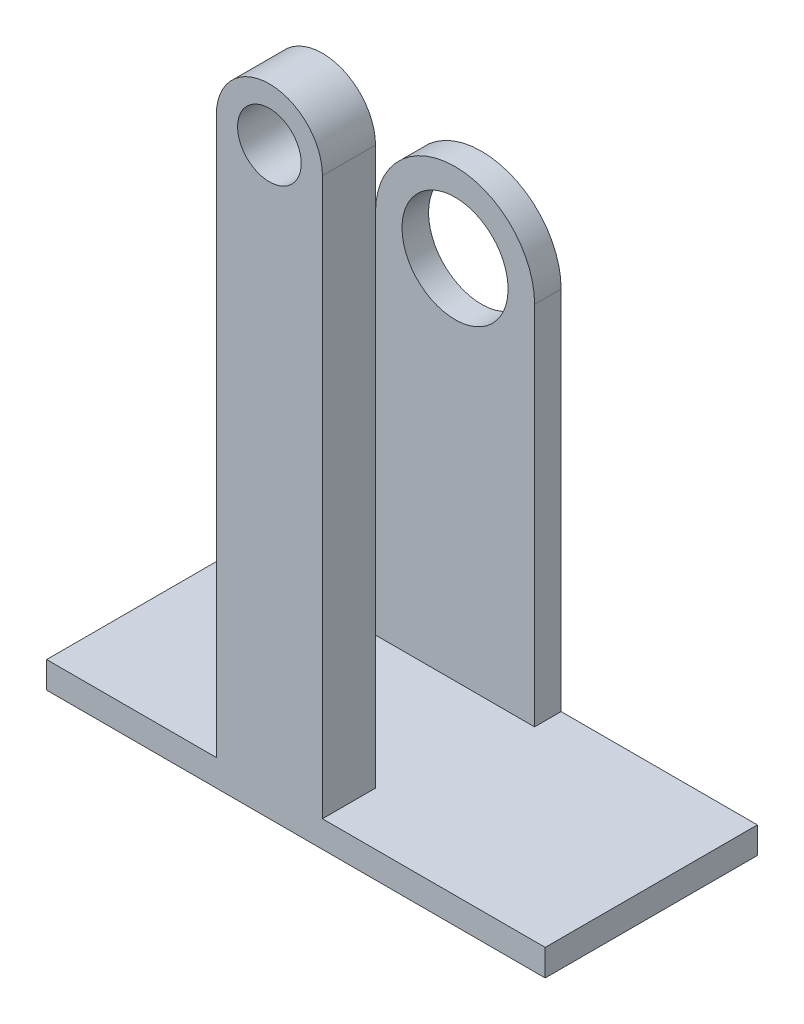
ISO-10303-21;
HEADER;
FILE_DESCRIPTION(('STEP AP214'),'2;1');
FILE_NAME('part.step','',(''),(''),'','','');
FILE_SCHEMA(('AUTOMOTIVE_DESIGN { 1 0 10303 214 1 1 1 1 }'));
ENDSEC;
DATA;
#1=APPLICATION_CONTEXT('core data for automotive mechanical design processes');
#2=APPLICATION_PROTOCOL_DEFINITION('international standard','automotive_design',2000,#1);
#3=PRODUCT_CONTEXT('',#1,'mechanical');
#4=PRODUCT('Part','Part','',(#3));
#5=PRODUCT_RELATED_PRODUCT_CATEGORY('part','',(#4));
#6=PRODUCT_DEFINITION_FORMATION('','',#4);
#7=PRODUCT_DEFINITION_CONTEXT('part definition',#1,'design');
#8=PRODUCT_DEFINITION('design','',#6,#7);
#9=PRODUCT_DEFINITION_SHAPE('','',#8);
#10=(LENGTH_UNIT() NAMED_UNIT(*) SI_UNIT(.MILLI.,.METRE.));
#11=(NAMED_UNIT(*) PLANE_ANGLE_UNIT() SI_UNIT($,.RADIAN.));
#12=(NAMED_UNIT(*) SI_UNIT($,.STERADIAN.) SOLID_ANGLE_UNIT());
#13=UNCERTAINTY_MEASURE_WITH_UNIT(LENGTH_MEASURE(1.E-05),#10,'distance_accuracy_value','');
#14=(GEOMETRIC_REPRESENTATION_CONTEXT(3) GLOBAL_UNCERTAINTY_ASSIGNED_CONTEXT((#13)) GLOBAL_UNIT_ASSIGNED_CONTEXT((#10,
#11,#12)) REPRESENTATION_CONTEXT('',''));
#15=CARTESIAN_POINT('',(0.,0.,0.));
#16=DIRECTION('',(0.,0.,1.));
#17=DIRECTION('',(1.,0.,0.));
#18=AXIS2_PLACEMENT_3D('',#15,#16,#17);
#19=CARTESIAN_POINT('',(0.,36.,10.));
#20=DIRECTION('',(0.,0.,1.));
#21=DIRECTION('',(1.,0.,0.));
#22=AXIS2_PLACEMENT_3D('',#19,#20,#21);
#23=PLANE('',#22);
#24=DIRECTION('',(0.,-1.,0.));
#25=VECTOR('',#24,1.);
#26=CARTESIAN_POINT('',(-10.,36.,10.));
#27=LINE('',#26,#25);
#28=CARTESIAN_POINT('',(-10.,36.,10.));
#29=VERTEX_POINT('',#28);
#30=CARTESIAN_POINT('',(-9.99999999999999,-69.,10.));
#31=VERTEX_POINT('',#30);
#32=EDGE_CURVE('E199',#29,#31,#27,.T.);
#33=ORIENTED_EDGE('',*,*,#32,.T.);
#34=DIRECTION('',(-1.,0.,0.));
#35=VECTOR('',#34,1.);
#36=CARTESIAN_POINT('',(-42.,-69.,10.));
#37=LINE('',#36,#35);
#38=CARTESIAN_POINT('',(-42.,-69.,10.));
#39=VERTEX_POINT('',#38);
#40=EDGE_CURVE('E168',#31,#39,#37,.T.);
#41=ORIENTED_EDGE('',*,*,#40,.T.);
#42=DIRECTION('',(0.,-1.,0.));
#43=VECTOR('',#42,1.);
#44=CARTESIAN_POINT('',(-42.,-74.,10.));
#45=LINE('',#44,#43);
#46=CARTESIAN_POINT('',(-42.,-74.,10.));
#47=VERTEX_POINT('',#46);
#48=EDGE_CURVE('E162',#39,#47,#45,.T.);
#49=ORIENTED_EDGE('',*,*,#48,.T.);
#50=DIRECTION('',(1.,0.,0.));
#51=VECTOR('',#50,1.);
#52=CARTESIAN_POINT('',(-9.99999999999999,-74.,10.));
#53=LINE('',#52,#51);
#54=CARTESIAN_POINT('',(52.,-74.,10.));
#55=VERTEX_POINT('',#54);
#56=EDGE_CURVE('E202',#47,#55,#53,.T.);
#57=ORIENTED_EDGE('',*,*,#56,.T.);
#58=DIRECTION('',(0.,1.,0.));
#59=VECTOR('',#58,1.);
#60=CARTESIAN_POINT('',(52.,-74.,10.));
#61=LINE('',#60,#59);
#62=CARTESIAN_POINT('',(52.,-69.,10.));
#63=VERTEX_POINT('',#62);
#64=EDGE_CURVE('E165',#55,#63,#61,.T.);
#65=ORIENTED_EDGE('',*,*,#64,.T.);
#66=CARTESIAN_POINT('',(10.,-69.,10.));
#67=VERTEX_POINT('',#66);
#68=EDGE_CURVE('E169',#63,#67,#37,.T.);
#69=ORIENTED_EDGE('',*,*,#68,.T.);
#70=DIRECTION('',(0.,1.,0.));
#71=VECTOR('',#70,1.);
#72=CARTESIAN_POINT('',(10.,-74.,10.));
#73=LINE('',#72,#71);
#74=CARTESIAN_POINT('',(10.,36.,10.));
#75=VERTEX_POINT('',#74);
#76=EDGE_CURVE('E204',#67,#75,#73,.T.);
#77=ORIENTED_EDGE('',*,*,#76,.T.);
#78=CARTESIAN_POINT('',(0.,36.,10.));
#79=DIRECTION('',(0.,0.,1.));
#80=DIRECTION('',(1.,0.,0.));
#81=AXIS2_PLACEMENT_3D('',#78,#79,#80);
#82=CIRCLE('',#81,10.);
#83=EDGE_CURVE('E226',#75,#29,#82,.T.);
#84=ORIENTED_EDGE('',*,*,#83,.T.);
#85=EDGE_LOOP('',(#33,#41,#49,#57,#65,#69,#77,#84));
#86=FACE_BOUND('',#85,.T.);
#87=CARTESIAN_POINT('',(0.,36.,10.));
#88=DIRECTION('',(0.,0.,1.));
#89=DIRECTION('',(1.,0.,0.));
#90=AXIS2_PLACEMENT_3D('',#87,#88,#89);
#91=CIRCLE('',#90,6.);
#92=CARTESIAN_POINT('',(6.,36.,10.));
#93=VERTEX_POINT('',#92);
#94=EDGE_CURVE('E220',#93,#93,#91,.T.);
#95=ORIENTED_EDGE('',*,*,#94,.F.);
#96=EDGE_LOOP('',(#95));
#97=FACE_BOUND('',#96,.T.);
#98=ADVANCED_FACE('F34',(#86,#97),#23,.T.);
#99=CARTESIAN_POINT('',(0.,36.,0.));
#100=DIRECTION('',(0.,0.,1.));
#101=DIRECTION('',(1.,0.,0.));
#102=AXIS2_PLACEMENT_3D('',#99,#100,#101);
#103=PLANE('',#102);
#104=DIRECTION('',(0.,1.,0.));
#105=VECTOR('',#104,1.);
#106=CARTESIAN_POINT('',(10.,-74.,0.));
#107=LINE('',#106,#105);
#108=CARTESIAN_POINT('',(10.,-69.,0.));
#109=VERTEX_POINT('',#108);
#110=CARTESIAN_POINT('',(10.,36.,0.));
#111=VERTEX_POINT('',#110);
#112=EDGE_CURVE('E209',#109,#111,#107,.T.);
#113=ORIENTED_EDGE('',*,*,#112,.F.);
#114=DIRECTION('',(-1.,0.,0.));
#115=VECTOR('',#114,1.);
#116=CARTESIAN_POINT('',(0.,-69.,0.));
#117=LINE('',#116,#115);
#118=CARTESIAN_POINT('',(-9.99999999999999,-69.,0.));
#119=VERTEX_POINT('',#118);
#120=EDGE_CURVE('E187',#109,#119,#117,.T.);
#121=ORIENTED_EDGE('',*,*,#120,.T.);
#122=DIRECTION('',(0.,-1.,0.));
#123=VECTOR('',#122,1.);
#124=CARTESIAN_POINT('',(-10.,36.,0.));
#125=LINE('',#124,#123);
#126=CARTESIAN_POINT('',(-10.,36.,0.));
#127=VERTEX_POINT('',#126);
#128=EDGE_CURVE('E206',#127,#119,#125,.T.);
#129=ORIENTED_EDGE('',*,*,#128,.F.);
#130=CARTESIAN_POINT('',(0.,36.,0.));
#131=DIRECTION('',(0.,0.,1.));
#132=DIRECTION('',(1.,0.,0.));
#133=AXIS2_PLACEMENT_3D('',#130,#131,#132);
#134=CIRCLE('',#133,10.);
#135=EDGE_CURVE('E223',#111,#127,#134,.T.);
#136=ORIENTED_EDGE('',*,*,#135,.F.);
#137=EDGE_LOOP('',(#113,#121,#129,#136));
#138=FACE_BOUND('',#137,.T.);
#139=CARTESIAN_POINT('',(0.,36.,0.));
#140=DIRECTION('',(0.,0.,1.));
#141=DIRECTION('',(1.,0.,0.));
#142=AXIS2_PLACEMENT_3D('',#139,#140,#141);
#143=CIRCLE('',#142,6.);
#144=CARTESIAN_POINT('',(6.,36.,0.));
#145=VERTEX_POINT('',#144);
#146=EDGE_CURVE('E215',#145,#145,#143,.T.);
#147=ORIENTED_EDGE('',*,*,#146,.T.);
#148=EDGE_LOOP('',(#147));
#149=FACE_BOUND('',#148,.T.);
#150=ADVANCED_FACE('F235',(#138,#149),#103,.F.);
#151=CARTESIAN_POINT('',(0.,36.,10.));
#152=DIRECTION('',(0.,0.,-1.));
#153=DIRECTION('',(-1.,0.,0.));
#154=AXIS2_PLACEMENT_3D('',#151,#152,#153);
#155=CYLINDRICAL_SURFACE('',#154,10.);
#156=ORIENTED_EDGE('',*,*,#83,.F.);
#157=DIRECTION('',(0.,0.,1.));
#158=VECTOR('',#157,1.);
#159=CARTESIAN_POINT('',(10.,36.,0.));
#160=LINE('',#159,#158);
#161=EDGE_CURVE('E212',#111,#75,#160,.T.);
#162=ORIENTED_EDGE('',*,*,#161,.F.);
#163=ORIENTED_EDGE('',*,*,#135,.T.);
#164=DIRECTION('',(0.,0.,1.));
#165=VECTOR('',#164,1.);
#166=CARTESIAN_POINT('',(-10.,36.,0.));
#167=LINE('',#166,#165);
#168=EDGE_CURVE('E211',#127,#29,#167,.T.);
#169=ORIENTED_EDGE('',*,*,#168,.T.);
#170=EDGE_LOOP('',(#156,#162,#163,#169));
#171=FACE_BOUND('',#170,.T.);
#172=ADVANCED_FACE('F36',(#171),#155,.T.);
#173=CARTESIAN_POINT('',(0.,36.,10.));
#174=DIRECTION('',(0.,0.,-1.));
#175=DIRECTION('',(-1.,0.,0.));
#176=AXIS2_PLACEMENT_3D('',#173,#174,#175);
#177=CYLINDRICAL_SURFACE('',#176,6.);
#178=ORIENTED_EDGE('',*,*,#94,.T.);
#179=EDGE_LOOP('',(#178));
#180=FACE_BOUND('',#179,.T.);
#181=ORIENTED_EDGE('',*,*,#146,.F.);
#182=EDGE_LOOP('',(#181));
#183=FACE_BOUND('',#182,.T.);
#184=ADVANCED_FACE('F290',(#180,#183),#177,.F.);
#185=CARTESIAN_POINT('',(10.,-74.,0.));
#186=DIRECTION('',(1.,0.,0.));
#187=DIRECTION('',(0.,0.,-1.));
#188=AXIS2_PLACEMENT_3D('',#185,#186,#187);
#189=PLANE('',#188);
#190=DIRECTION('',(0.,0.,1.));
#191=VECTOR('',#190,1.);
#192=CARTESIAN_POINT('',(10.,-69.,0.));
#193=LINE('',#192,#191);
#194=EDGE_CURVE('E197',#109,#67,#193,.T.);
#195=ORIENTED_EDGE('',*,*,#194,.F.);
#196=ORIENTED_EDGE('',*,*,#112,.T.);
#197=ORIENTED_EDGE('',*,*,#161,.T.);
#198=ORIENTED_EDGE('',*,*,#76,.F.);
#199=EDGE_LOOP('',(#195,#196,#197,#198));
#200=FACE_BOUND('',#199,.T.);
#201=ADVANCED_FACE('F247',(#200),#189,.T.);
#202=CARTESIAN_POINT('',(-9.99999999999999,-74.,0.));
#203=DIRECTION('',(0.,-1.,0.));
#204=DIRECTION('',(0.,0.,-1.));
#205=AXIS2_PLACEMENT_3D('',#202,#203,#204);
#206=PLANE('',#205);
#207=DIRECTION('',(1.,0.,0.));
#208=VECTOR('',#207,1.);
#209=CARTESIAN_POINT('',(-42.,-74.,-30.));
#210=LINE('',#209,#208);
#211=CARTESIAN_POINT('',(-42.,-74.,-30.));
#212=VERTEX_POINT('',#211);
#213=CARTESIAN_POINT('',(52.,-74.,-30.));
#214=VERTEX_POINT('',#213);
#215=EDGE_CURVE('E175',#212,#214,#210,.T.);
#216=ORIENTED_EDGE('',*,*,#215,.T.);
#217=DIRECTION('',(0.,0.,1.));
#218=VECTOR('',#217,1.);
#219=CARTESIAN_POINT('',(52.,-74.,-30.));
#220=LINE('',#219,#218);
#221=EDGE_CURVE('E190',#214,#55,#220,.T.);
#222=ORIENTED_EDGE('',*,*,#221,.T.);
#223=ORIENTED_EDGE('',*,*,#56,.F.);
#224=DIRECTION('',(0.,0.,1.));
#225=VECTOR('',#224,1.);
#226=CARTESIAN_POINT('',(-42.,-74.,-30.));
#227=LINE('',#226,#225);
#228=EDGE_CURVE('E183',#212,#47,#227,.T.);
#229=ORIENTED_EDGE('',*,*,#228,.F.);
#230=EDGE_LOOP('',(#216,#222,#223,#229));
#231=FACE_BOUND('',#230,.T.);
#232=ADVANCED_FACE('F296',(#231),#206,.T.);
#233=CARTESIAN_POINT('',(-10.,36.,0.));
#234=DIRECTION('',(-1.,0.,0.));
#235=DIRECTION('',(0.,-1.,0.));
#236=AXIS2_PLACEMENT_3D('',#233,#234,#235);
#237=PLANE('',#236);
#238=DIRECTION('',(0.,0.,-1.));
#239=VECTOR('',#238,1.);
#240=CARTESIAN_POINT('',(-9.99999999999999,-69.,0.));
#241=LINE('',#240,#239);
#242=EDGE_CURVE('E42',#31,#119,#241,.T.);
#243=ORIENTED_EDGE('',*,*,#242,.F.);
#244=ORIENTED_EDGE('',*,*,#32,.F.);
#245=ORIENTED_EDGE('',*,*,#168,.F.);
#246=ORIENTED_EDGE('',*,*,#128,.T.);
#247=EDGE_LOOP('',(#243,#244,#245,#246));
#248=FACE_BOUND('',#247,.T.);
#249=ADVANCED_FACE('F238',(#248),#237,.T.);
#250=CARTESIAN_POINT('',(-42.,-74.,-30.));
#251=DIRECTION('',(-1.,0.,0.));
#252=DIRECTION('',(0.,0.,1.));
#253=AXIS2_PLACEMENT_3D('',#250,#251,#252);
#254=PLANE('',#253);
#255=ORIENTED_EDGE('',*,*,#48,.F.);
#256=DIRECTION('',(0.,0.,1.));
#257=VECTOR('',#256,1.);
#258=CARTESIAN_POINT('',(-42.,-69.,-30.));
#259=LINE('',#258,#257);
#260=CARTESIAN_POINT('',(-42.,-69.,-30.));
#261=VERTEX_POINT('',#260);
#262=EDGE_CURVE('E184',#261,#39,#259,.T.);
#263=ORIENTED_EDGE('',*,*,#262,.F.);
#264=DIRECTION('',(0.,-1.,0.));
#265=VECTOR('',#264,1.);
#266=CARTESIAN_POINT('',(-42.,-74.,-30.));
#267=LINE('',#266,#265);
#268=EDGE_CURVE('E172',#261,#212,#267,.T.);
#269=ORIENTED_EDGE('',*,*,#268,.T.);
#270=ORIENTED_EDGE('',*,*,#228,.T.);
#271=EDGE_LOOP('',(#255,#263,#269,#270));
#272=FACE_BOUND('',#271,.T.);
#273=ADVANCED_FACE('F258',(#272),#254,.T.);
#274=CARTESIAN_POINT('',(-42.,-69.,-30.));
#275=DIRECTION('',(0.,1.,0.));
#276=DIRECTION('',(0.,0.,1.));
#277=AXIS2_PLACEMENT_3D('',#274,#275,#276);
#278=PLANE('',#277);
#279=DIRECTION('',(0.,0.,1.));
#280=VECTOR('',#279,1.);
#281=CARTESIAN_POINT('',(-15.,-69.,-30.));
#282=LINE('',#281,#280);
#283=CARTESIAN_POINT('',(-15.,-69.,-30.));
#284=VERTEX_POINT('',#283);
#285=CARTESIAN_POINT('',(-15.,-69.,-25.));
#286=VERTEX_POINT('',#285);
#287=EDGE_CURVE('E160',#284,#286,#282,.T.);
#288=ORIENTED_EDGE('',*,*,#287,.F.);
#289=DIRECTION('',(-1.,0.,0.));
#290=VECTOR('',#289,1.);
#291=CARTESIAN_POINT('',(-42.,-69.,-30.));
#292=LINE('',#291,#290);
#293=EDGE_CURVE('E180',#284,#261,#292,.T.);
#294=ORIENTED_EDGE('',*,*,#293,.T.);
#295=ORIENTED_EDGE('',*,*,#262,.T.);
#296=ORIENTED_EDGE('',*,*,#40,.F.);
#297=ORIENTED_EDGE('',*,*,#242,.T.);
#298=ORIENTED_EDGE('',*,*,#120,.F.);
#299=ORIENTED_EDGE('',*,*,#194,.T.);
#300=ORIENTED_EDGE('',*,*,#68,.F.);
#301=DIRECTION('',(0.,0.,1.));
#302=VECTOR('',#301,1.);
#303=CARTESIAN_POINT('',(52.,-69.,-30.));
#304=LINE('',#303,#302);
#305=CARTESIAN_POINT('',(52.,-69.,-30.));
#306=VERTEX_POINT('',#305);
#307=EDGE_CURVE('E188',#306,#63,#304,.T.);
#308=ORIENTED_EDGE('',*,*,#307,.F.);
#309=CARTESIAN_POINT('',(15.,-69.,-30.));
#310=VERTEX_POINT('',#309);
#311=EDGE_CURVE('E181',#306,#310,#292,.T.);
#312=ORIENTED_EDGE('',*,*,#311,.T.);
#313=DIRECTION('',(0.,0.,-1.));
#314=VECTOR('',#313,1.);
#315=CARTESIAN_POINT('',(15.,-69.,-30.));
#316=LINE('',#315,#314);
#317=CARTESIAN_POINT('',(15.,-69.,-25.));
#318=VERTEX_POINT('',#317);
#319=EDGE_CURVE('E52',#318,#310,#316,.T.);
#320=ORIENTED_EDGE('',*,*,#319,.F.);
#321=DIRECTION('',(-1.,0.,0.));
#322=VECTOR('',#321,1.);
#323=CARTESIAN_POINT('',(-42.,-69.,-25.));
#324=LINE('',#323,#322);
#325=EDGE_CURVE('E11',#318,#286,#324,.T.);
#326=ORIENTED_EDGE('',*,*,#325,.T.);
#327=EDGE_LOOP('',(#288,#294,#295,#296,#297,#298,#299,#300,#308,#312,#320,#326));
#328=FACE_BOUND('',#327,.T.);
#329=ADVANCED_FACE('F229',(#328),#278,.T.);
#330=CARTESIAN_POINT('',(52.,-74.,-30.));
#331=DIRECTION('',(1.,0.,0.));
#332=DIRECTION('',(0.,0.,-1.));
#333=AXIS2_PLACEMENT_3D('',#330,#331,#332);
#334=PLANE('',#333);
#335=ORIENTED_EDGE('',*,*,#64,.F.);
#336=ORIENTED_EDGE('',*,*,#221,.F.);
#337=DIRECTION('',(0.,1.,0.));
#338=VECTOR('',#337,1.);
#339=CARTESIAN_POINT('',(52.,-74.,-30.));
#340=LINE('',#339,#338);
#341=EDGE_CURVE('E177',#214,#306,#340,.T.);
#342=ORIENTED_EDGE('',*,*,#341,.T.);
#343=ORIENTED_EDGE('',*,*,#307,.T.);
#344=EDGE_LOOP('',(#335,#336,#342,#343));
#345=FACE_BOUND('',#344,.T.);
#346=ADVANCED_FACE('F251',(#345),#334,.T.);
#347=CARTESIAN_POINT('',(-42.,-69.,-30.));
#348=DIRECTION('',(0.,0.,-1.));
#349=DIRECTION('',(-1.,0.,0.));
#350=AXIS2_PLACEMENT_3D('',#347,#348,#349);
#351=PLANE('',#350);
#352=ORIENTED_EDGE('',*,*,#341,.F.);
#353=ORIENTED_EDGE('',*,*,#215,.F.);
#354=ORIENTED_EDGE('',*,*,#268,.F.);
#355=ORIENTED_EDGE('',*,*,#293,.F.);
#356=DIRECTION('',(0.,1.,0.));
#357=VECTOR('',#356,1.);
#358=CARTESIAN_POINT('',(-15.,0.,-30.));
#359=LINE('',#358,#357);
#360=CARTESIAN_POINT('',(-15.,0.,-30.));
#361=VERTEX_POINT('',#360);
#362=EDGE_CURVE('E139',#284,#361,#359,.T.);
#363=ORIENTED_EDGE('',*,*,#362,.T.);
#364=CARTESIAN_POINT('',(0.,0.,-30.));
#365=DIRECTION('',(0.,0.,-1.));
#366=DIRECTION('',(-1.,0.,0.));
#367=AXIS2_PLACEMENT_3D('',#364,#365,#366);
#368=CIRCLE('',#367,15.);
#369=CARTESIAN_POINT('',(15.,0.,-30.));
#370=VERTEX_POINT('',#369);
#371=EDGE_CURVE('E125',#361,#370,#368,.T.);
#372=ORIENTED_EDGE('',*,*,#371,.T.);
#373=DIRECTION('',(0.,-1.,0.));
#374=VECTOR('',#373,1.);
#375=CARTESIAN_POINT('',(15.,0.,-30.));
#376=LINE('',#375,#374);
#377=EDGE_CURVE('E135',#370,#310,#376,.T.);
#378=ORIENTED_EDGE('',*,*,#377,.T.);
#379=ORIENTED_EDGE('',*,*,#311,.F.);
#380=EDGE_LOOP('',(#352,#353,#354,#355,#363,#372,#378,#379));
#381=FACE_BOUND('',#380,.T.);
#382=CARTESIAN_POINT('',(0.,0.,-30.));
#383=DIRECTION('',(0.,0.,-1.));
#384=DIRECTION('',(-1.,0.,0.));
#385=AXIS2_PLACEMENT_3D('',#382,#383,#384);
#386=CIRCLE('',#385,10.);
#387=CARTESIAN_POINT('',(-10.,0.,-30.));
#388=VERTEX_POINT('',#387);
#389=EDGE_CURVE('E149',#388,#388,#386,.T.);
#390=ORIENTED_EDGE('',*,*,#389,.F.);
#391=EDGE_LOOP('',(#390));
#392=FACE_BOUND('',#391,.T.);
#393=ADVANCED_FACE('F142',(#381,#392),#351,.T.);
#394=CARTESIAN_POINT('',(0.,0.,-25.));
#395=DIRECTION('',(0.,0.,-1.));
#396=DIRECTION('',(-1.,0.,0.));
#397=AXIS2_PLACEMENT_3D('',#394,#395,#396);
#398=CYLINDRICAL_SURFACE('',#397,15.);
#399=ORIENTED_EDGE('',*,*,#371,.F.);
#400=DIRECTION('',(0.,0.,-1.));
#401=VECTOR('',#400,1.);
#402=CARTESIAN_POINT('',(-15.,0.,-25.));
#403=LINE('',#402,#401);
#404=CARTESIAN_POINT('',(-15.,0.,-25.));
#405=VERTEX_POINT('',#404);
#406=EDGE_CURVE('E131',#405,#361,#403,.T.);
#407=ORIENTED_EDGE('',*,*,#406,.F.);
#408=CARTESIAN_POINT('',(0.,0.,-25.));
#409=DIRECTION('',(0.,0.,-1.));
#410=DIRECTION('',(-1.,0.,0.));
#411=AXIS2_PLACEMENT_3D('',#408,#409,#410);
#412=CIRCLE('',#411,15.);
#413=CARTESIAN_POINT('',(15.,0.,-25.));
#414=VERTEX_POINT('',#413);
#415=EDGE_CURVE('E127',#405,#414,#412,.T.);
#416=ORIENTED_EDGE('',*,*,#415,.T.);
#417=DIRECTION('',(0.,0.,-1.));
#418=VECTOR('',#417,1.);
#419=CARTESIAN_POINT('',(15.,0.,-25.));
#420=LINE('',#419,#418);
#421=EDGE_CURVE('E120',#414,#370,#420,.T.);
#422=ORIENTED_EDGE('',*,*,#421,.T.);
#423=EDGE_LOOP('',(#399,#407,#416,#422));
#424=FACE_BOUND('',#423,.T.);
#425=ADVANCED_FACE('F122',(#424),#398,.T.);
#426=CARTESIAN_POINT('',(-15.,0.,-25.));
#427=DIRECTION('',(-1.,0.,0.));
#428=DIRECTION('',(0.,0.,1.));
#429=AXIS2_PLACEMENT_3D('',#426,#427,#428);
#430=PLANE('',#429);
#431=ORIENTED_EDGE('',*,*,#362,.F.);
#432=ORIENTED_EDGE('',*,*,#287,.T.);
#433=DIRECTION('',(0.,1.,0.));
#434=VECTOR('',#433,1.);
#435=CARTESIAN_POINT('',(-15.,0.,-25.));
#436=LINE('',#435,#434);
#437=EDGE_CURVE('E132',#286,#405,#436,.T.);
#438=ORIENTED_EDGE('',*,*,#437,.T.);
#439=ORIENTED_EDGE('',*,*,#406,.T.);
#440=EDGE_LOOP('',(#431,#432,#438,#439));
#441=FACE_BOUND('',#440,.T.);
#442=ADVANCED_FACE('F261',(#441),#430,.T.);
#443=CARTESIAN_POINT('',(15.,0.,-25.));
#444=DIRECTION('',(1.,0.,0.));
#445=DIRECTION('',(0.,0.,-1.));
#446=AXIS2_PLACEMENT_3D('',#443,#444,#445);
#447=PLANE('',#446);
#448=DIRECTION('',(0.,-1.,0.));
#449=VECTOR('',#448,1.);
#450=CARTESIAN_POINT('',(15.,0.,-25.));
#451=LINE('',#450,#449);
#452=EDGE_CURVE('E155',#414,#318,#451,.T.);
#453=ORIENTED_EDGE('',*,*,#452,.T.);
#454=ORIENTED_EDGE('',*,*,#319,.T.);
#455=ORIENTED_EDGE('',*,*,#377,.F.);
#456=ORIENTED_EDGE('',*,*,#421,.F.);
#457=EDGE_LOOP('',(#453,#454,#455,#456));
#458=FACE_BOUND('',#457,.T.);
#459=ADVANCED_FACE('F136',(#458),#447,.T.);
#460=CARTESIAN_POINT('',(0.,0.,-25.));
#461=DIRECTION('',(0.,0.,-1.));
#462=DIRECTION('',(-1.,0.,0.));
#463=AXIS2_PLACEMENT_3D('',#460,#461,#462);
#464=PLANE('',#463);
#465=ORIENTED_EDGE('',*,*,#325,.F.);
#466=ORIENTED_EDGE('',*,*,#452,.F.);
#467=ORIENTED_EDGE('',*,*,#415,.F.);
#468=ORIENTED_EDGE('',*,*,#437,.F.);
#469=EDGE_LOOP('',(#465,#466,#467,#468));
#470=FACE_BOUND('',#469,.T.);
#471=CARTESIAN_POINT('',(0.,0.,-25.));
#472=DIRECTION('',(0.,0.,-1.));
#473=DIRECTION('',(-1.,0.,0.));
#474=AXIS2_PLACEMENT_3D('',#471,#472,#473);
#475=CIRCLE('',#474,10.);
#476=CARTESIAN_POINT('',(-10.,0.,-25.));
#477=VERTEX_POINT('',#476);
#478=EDGE_CURVE('E146',#477,#477,#475,.T.);
#479=ORIENTED_EDGE('',*,*,#478,.T.);
#480=EDGE_LOOP('',(#479));
#481=FACE_BOUND('',#480,.T.);
#482=ADVANCED_FACE('F263',(#470,#481),#464,.F.);
#483=CARTESIAN_POINT('',(0.,0.,-25.));
#484=DIRECTION('',(0.,0.,-1.));
#485=DIRECTION('',(-1.,0.,0.));
#486=AXIS2_PLACEMENT_3D('',#483,#484,#485);
#487=CYLINDRICAL_SURFACE('',#486,10.);
#488=ORIENTED_EDGE('',*,*,#478,.F.);
#489=EDGE_LOOP('',(#488));
#490=FACE_BOUND('',#489,.T.);
#491=ORIENTED_EDGE('',*,*,#389,.T.);
#492=EDGE_LOOP('',(#491));
#493=FACE_BOUND('',#492,.T.);
#494=ADVANCED_FACE('F266',(#490,#493),#487,.F.);
#495=CLOSED_SHELL('',(#98,#150,#172,#184,#201,#232,#249,#273,#329,#346,#393,#425,#442,#459,#482,#494));
#496=MANIFOLD_SOLID_BREP('B2',#495);
#497=ADVANCED_BREP_SHAPE_REPRESENTATION('',(#18,#496),#14);
#498=SHAPE_DEFINITION_REPRESENTATION(#9,#497);
ENDSEC;
END-ISO-10303-21;
